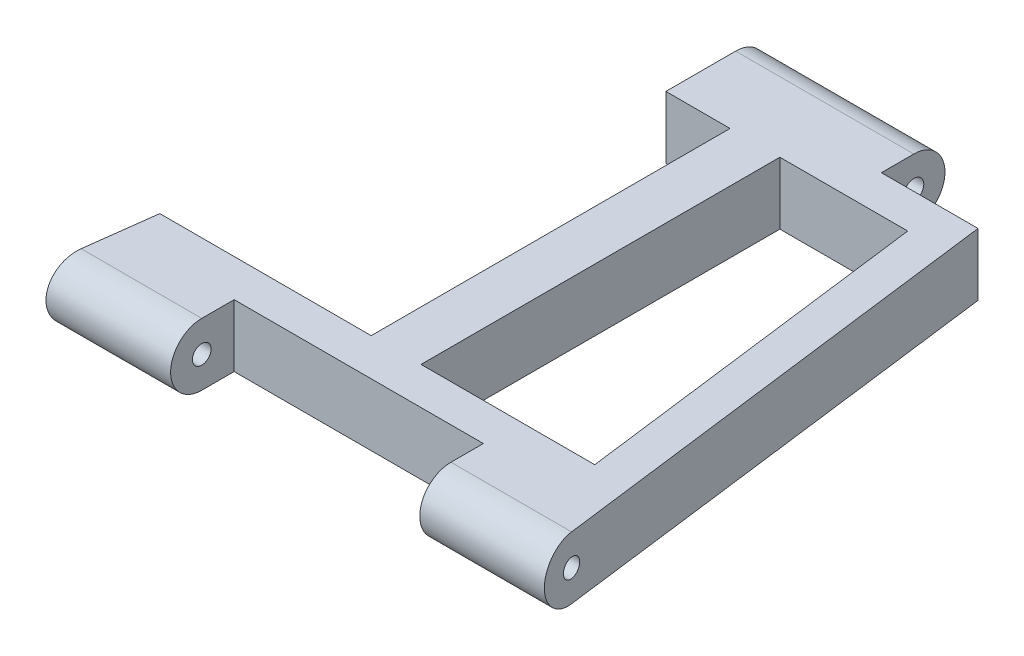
ISO-10303-21;
HEADER;
FILE_DESCRIPTION(('STEP AP214'),'2;1');
FILE_NAME('part.step','',(''),(''),'','','');
FILE_SCHEMA(('AUTOMOTIVE_DESIGN { 1 0 10303 214 1 1 1 1 }'));
ENDSEC;
DATA;
#1=APPLICATION_CONTEXT('core data for automotive mechanical design processes');
#2=APPLICATION_PROTOCOL_DEFINITION('international standard','automotive_design',2000,#1);
#3=PRODUCT_CONTEXT('',#1,'mechanical');
#4=PRODUCT('Part','Part','',(#3));
#5=PRODUCT_RELATED_PRODUCT_CATEGORY('part','',(#4));
#6=PRODUCT_DEFINITION_FORMATION('','',#4);
#7=PRODUCT_DEFINITION_CONTEXT('part definition',#1,'design');
#8=PRODUCT_DEFINITION('design','',#6,#7);
#9=PRODUCT_DEFINITION_SHAPE('','',#8);
#10=(LENGTH_UNIT() NAMED_UNIT(*) SI_UNIT(.MILLI.,.METRE.));
#11=(NAMED_UNIT(*) PLANE_ANGLE_UNIT() SI_UNIT($,.RADIAN.));
#12=(NAMED_UNIT(*) SI_UNIT($,.STERADIAN.) SOLID_ANGLE_UNIT());
#13=UNCERTAINTY_MEASURE_WITH_UNIT(LENGTH_MEASURE(1.E-05),#10,'distance_accuracy_value','');
#14=(GEOMETRIC_REPRESENTATION_CONTEXT(3) GLOBAL_UNCERTAINTY_ASSIGNED_CONTEXT((#13)) GLOBAL_UNIT_ASSIGNED_CONTEXT((#10,
#11,#12)) REPRESENTATION_CONTEXT('',''));
#15=CARTESIAN_POINT('',(0.,0.,0.));
#16=DIRECTION('',(0.,0.,1.));
#17=DIRECTION('',(1.,0.,0.));
#18=AXIS2_PLACEMENT_3D('',#15,#16,#17);
#19=CARTESIAN_POINT('',(-56.5293337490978,10.,7.22319264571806));
#20=DIRECTION('',(0.991935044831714,0.,-0.126747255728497));
#21=DIRECTION('',(-0.126747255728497,0.,-0.991935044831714));
#22=AXIS2_PLACEMENT_3D('',#19,#20,#21);
#23=PLANE('',#22);
#24=CARTESIAN_POINT('',(-60.1764107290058,5.,-21.3191489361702));
#25=DIRECTION('',(0.991935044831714,0.,-0.126747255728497));
#26=DIRECTION('',(-0.126747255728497,0.,-0.991935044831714));
#27=AXIS2_PLACEMENT_3D('',#24,#25,#26);
#28=ELLIPSE('',#27,1.5121957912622,1.5);
#29=CARTESIAN_POINT('',(-60.3680773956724,5.,-22.8191489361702));
#30=VERTEX_POINT('',#29);
#31=EDGE_CURVE('E379',#30,#30,#28,.T.);
#32=ORIENTED_EDGE('',*,*,#31,.F.);
#33=EDGE_LOOP('',(#32));
#34=FACE_BOUND('',#33,.T.);
#35=CARTESIAN_POINT('',(-60.1764107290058,5.,-21.3191489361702));
#36=DIRECTION('',(0.991935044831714,0.,-0.126747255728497));
#37=DIRECTION('',(-0.126747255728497,0.,-0.991935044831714));
#38=AXIS2_PLACEMENT_3D('',#35,#36,#37);
#39=ELLIPSE('',#38,5.04065263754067,5.);
#40=CARTESIAN_POINT('',(-60.1764107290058,10.,-21.3191489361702));
#41=VERTEX_POINT('',#40);
#42=CARTESIAN_POINT('',(-60.1764107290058,0.,-21.3191489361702));
#43=VERTEX_POINT('',#42);
#44=EDGE_CURVE('E286',#41,#43,#39,.T.);
#45=ORIENTED_EDGE('',*,*,#44,.T.);
#46=DIRECTION('',(0.126747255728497,0.,0.991935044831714));
#47=VECTOR('',#46,1.);
#48=CARTESIAN_POINT('',(-56.5293337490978,0.,7.22319264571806));
#49=LINE('',#48,#47);
#50=CARTESIAN_POINT('',(-69.7341885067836,0.,-96.1191489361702));
#51=VERTEX_POINT('',#50);
#52=EDGE_CURVE('E289',#51,#43,#49,.T.);
#53=ORIENTED_EDGE('',*,*,#52,.F.);
#54=DIRECTION('',(0.,-1.,0.));
#55=VECTOR('',#54,1.);
#56=CARTESIAN_POINT('',(-69.7341885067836,10.,-96.1191489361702));
#57=LINE('',#56,#55);
#58=CARTESIAN_POINT('',(-69.7341885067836,10.,-96.1191489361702));
#59=VERTEX_POINT('',#58);
#60=EDGE_CURVE('E170',#59,#51,#57,.T.);
#61=ORIENTED_EDGE('',*,*,#60,.F.);
#62=DIRECTION('',(0.126747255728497,0.,0.991935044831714));
#63=VECTOR('',#62,1.);
#64=CARTESIAN_POINT('',(-56.5293337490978,10.,7.22319264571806));
#65=LINE('',#64,#63);
#66=EDGE_CURVE('E292',#59,#41,#65,.T.);
#67=ORIENTED_EDGE('',*,*,#66,.T.);
#68=EDGE_LOOP('',(#45,#53,#61,#67));
#69=FACE_BOUND('',#68,.T.);
#70=ADVANCED_FACE('F162',(#34,#69),#23,.T.);
#71=CARTESIAN_POINT('',(-139.3475958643,10.,-17.805526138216));
#72=DIRECTION('',(0.991935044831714,0.,0.126747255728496));
#73=DIRECTION('',(0.126747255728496,0.,-0.991935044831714));
#74=AXIS2_PLACEMENT_3D('',#71,#72,#73);
#75=PLANE('',#74);
#76=CARTESIAN_POINT('',(-138.898632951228,5.,-21.3191489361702));
#77=DIRECTION('',(0.991935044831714,0.,0.126747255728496));
#78=DIRECTION('',(-0.126747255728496,0.,0.991935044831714));
#79=AXIS2_PLACEMENT_3D('',#76,#77,#78);
#80=ELLIPSE('',#79,1.5121957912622,1.5);
#81=CARTESIAN_POINT('',(-139.090299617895,5.,-19.8191489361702));
#82=VERTEX_POINT('',#81);
#83=EDGE_CURVE('E373',#82,#82,#80,.T.);
#84=ORIENTED_EDGE('',*,*,#83,.T.);
#85=EDGE_LOOP('',(#84));
#86=FACE_BOUND('',#85,.T.);
#87=DIRECTION('',(-0.126747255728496,0.,0.991935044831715));
#88=VECTOR('',#87,1.);
#89=CARTESIAN_POINT('',(-139.3475958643,0.,-17.805526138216));
#90=LINE('',#89,#88);
#91=CARTESIAN_POINT('',(-137.467521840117,0.,-32.5191489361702));
#92=VERTEX_POINT('',#91);
#93=CARTESIAN_POINT('',(-138.898632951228,0.,-21.3191489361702));
#94=VERTEX_POINT('',#93);
#95=EDGE_CURVE('E325',#92,#94,#90,.T.);
#96=ORIENTED_EDGE('',*,*,#95,.T.);
#97=CARTESIAN_POINT('',(-138.898632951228,5.,-21.3191489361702));
#98=DIRECTION('',(0.991935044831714,0.,0.126747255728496));
#99=DIRECTION('',(-0.126747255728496,0.,0.991935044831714));
#100=AXIS2_PLACEMENT_3D('',#97,#98,#99);
#101=ELLIPSE('',#100,5.04065263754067,5.);
#102=CARTESIAN_POINT('',(-138.898632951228,10.,-21.3191489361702));
#103=VERTEX_POINT('',#102);
#104=EDGE_CURVE('E294',#103,#94,#101,.T.);
#105=ORIENTED_EDGE('',*,*,#104,.F.);
#106=DIRECTION('',(-0.126747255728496,0.,0.991935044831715));
#107=VECTOR('',#106,1.);
#108=CARTESIAN_POINT('',(-139.3475958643,10.,-17.805526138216));
#109=LINE('',#108,#107);
#110=CARTESIAN_POINT('',(-137.467521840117,10.,-32.5191489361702));
#111=VERTEX_POINT('',#110);
#112=EDGE_CURVE('E421',#111,#103,#109,.T.);
#113=ORIENTED_EDGE('',*,*,#112,.F.);
#114=DIRECTION('',(0.,-1.,0.));
#115=VECTOR('',#114,1.);
#116=CARTESIAN_POINT('',(-137.467521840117,10.,-32.5191489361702));
#117=LINE('',#116,#115);
#118=EDGE_CURVE('E342',#111,#92,#117,.T.);
#119=ORIENTED_EDGE('',*,*,#118,.T.);
#120=EDGE_LOOP('',(#96,#105,#113,#119));
#121=FACE_BOUND('',#120,.T.);
#122=ADVANCED_FACE('F470',(#86,#121),#75,.F.);
#123=CARTESIAN_POINT('',(-119.537521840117,10.,0.));
#124=DIRECTION('',(1.,0.,0.));
#125=DIRECTION('',(0.,0.,-1.));
#126=AXIS2_PLACEMENT_3D('',#123,#124,#125);
#127=PLANE('',#126);
#128=CARTESIAN_POINT('',(-119.537521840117,5.,-21.3191489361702));
#129=DIRECTION('',(1.,0.,0.));
#130=DIRECTION('',(0.,0.,-1.));
#131=AXIS2_PLACEMENT_3D('',#128,#129,#130);
#132=CIRCLE('',#131,1.5);
#133=CARTESIAN_POINT('',(-119.537521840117,5.,-22.8191489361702));
#134=VERTEX_POINT('',#133);
#135=EDGE_CURVE('E369',#134,#134,#132,.T.);
#136=ORIENTED_EDGE('',*,*,#135,.F.);
#137=EDGE_LOOP('',(#136));
#138=FACE_BOUND('',#137,.T.);
#139=CARTESIAN_POINT('',(-119.537521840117,5.,-21.3191489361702));
#140=DIRECTION('',(1.,0.,0.));
#141=DIRECTION('',(0.,0.,-1.));
#142=AXIS2_PLACEMENT_3D('',#139,#140,#141);
#143=CIRCLE('',#142,5.);
#144=CARTESIAN_POINT('',(-119.537521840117,10.,-21.3191489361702));
#145=VERTEX_POINT('',#144);
#146=CARTESIAN_POINT('',(-119.537521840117,0.,-21.3191489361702));
#147=VERTEX_POINT('',#146);
#148=EDGE_CURVE('E382',#145,#147,#143,.T.);
#149=ORIENTED_EDGE('',*,*,#148,.T.);
#150=DIRECTION('',(0.,0.,1.));
#151=VECTOR('',#150,1.);
#152=CARTESIAN_POINT('',(-119.537521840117,0.,0.));
#153=LINE('',#152,#151);
#154=CARTESIAN_POINT('',(-119.537521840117,0.,-26.5191489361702));
#155=VERTEX_POINT('',#154);
#156=EDGE_CURVE('E328',#155,#147,#153,.T.);
#157=ORIENTED_EDGE('',*,*,#156,.F.);
#158=DIRECTION('',(0.,-1.,0.));
#159=VECTOR('',#158,1.);
#160=CARTESIAN_POINT('',(-119.537521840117,10.,-26.5191489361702));
#161=LINE('',#160,#159);
#162=CARTESIAN_POINT('',(-119.537521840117,10.,-26.5191489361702));
#163=VERTEX_POINT('',#162);
#164=EDGE_CURVE('E339',#163,#155,#161,.T.);
#165=ORIENTED_EDGE('',*,*,#164,.F.);
#166=DIRECTION('',(0.,0.,1.));
#167=VECTOR('',#166,1.);
#168=CARTESIAN_POINT('',(-119.537521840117,10.,0.));
#169=LINE('',#168,#167);
#170=EDGE_CURVE('E424',#163,#145,#169,.T.);
#171=ORIENTED_EDGE('',*,*,#170,.T.);
#172=EDGE_LOOP('',(#149,#157,#165,#171));
#173=FACE_BOUND('',#172,.T.);
#174=ADVANCED_FACE('F476',(#138,#173),#127,.T.);
#175=CARTESIAN_POINT('',(-79.5375218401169,10.,0.));
#176=DIRECTION('',(1.,0.,0.));
#177=DIRECTION('',(0.,0.,-1.));
#178=AXIS2_PLACEMENT_3D('',#175,#176,#177);
#179=PLANE('',#178);
#180=CARTESIAN_POINT('',(-79.5375218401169,5.,-21.3191489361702));
#181=DIRECTION('',(1.,0.,0.));
#182=DIRECTION('',(0.,0.,-1.));
#183=AXIS2_PLACEMENT_3D('',#180,#181,#182);
#184=CIRCLE('',#183,1.5);
#185=CARTESIAN_POINT('',(-79.5375218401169,5.,-22.8191489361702));
#186=VERTEX_POINT('',#185);
#187=EDGE_CURVE('E367',#186,#186,#184,.T.);
#188=ORIENTED_EDGE('',*,*,#187,.T.);
#189=EDGE_LOOP('',(#188));
#190=FACE_BOUND('',#189,.T.);
#191=DIRECTION('',(0.,0.,1.));
#192=VECTOR('',#191,1.);
#193=CARTESIAN_POINT('',(-79.5375218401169,0.,0.));
#194=LINE('',#193,#192);
#195=CARTESIAN_POINT('',(-79.5375218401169,0.,-26.5191489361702));
#196=VERTEX_POINT('',#195);
#197=CARTESIAN_POINT('',(-79.5375218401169,0.,-21.3191489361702));
#198=VERTEX_POINT('',#197);
#199=EDGE_CURVE('E333',#196,#198,#194,.T.);
#200=ORIENTED_EDGE('',*,*,#199,.T.);
#201=CARTESIAN_POINT('',(-79.5375218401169,5.,-21.3191489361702));
#202=DIRECTION('',(1.,0.,0.));
#203=DIRECTION('',(0.,0.,-1.));
#204=AXIS2_PLACEMENT_3D('',#201,#202,#203);
#205=CIRCLE('',#204,5.);
#206=CARTESIAN_POINT('',(-79.5375218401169,10.,-21.3191489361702));
#207=VERTEX_POINT('',#206);
#208=EDGE_CURVE('E12',#207,#198,#205,.T.);
#209=ORIENTED_EDGE('',*,*,#208,.F.);
#210=DIRECTION('',(0.,0.,1.));
#211=VECTOR('',#210,1.);
#212=CARTESIAN_POINT('',(-79.5375218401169,10.,0.));
#213=LINE('',#212,#211);
#214=CARTESIAN_POINT('',(-79.5375218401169,10.,-26.5191489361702));
#215=VERTEX_POINT('',#214);
#216=EDGE_CURVE('E362',#215,#207,#213,.T.);
#217=ORIENTED_EDGE('',*,*,#216,.F.);
#218=DIRECTION('',(0.,-1.,0.));
#219=VECTOR('',#218,1.);
#220=CARTESIAN_POINT('',(-79.5375218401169,10.,-26.5191489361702));
#221=LINE('',#220,#219);
#222=EDGE_CURVE('E336',#215,#196,#221,.T.);
#223=ORIENTED_EDGE('',*,*,#222,.T.);
#224=EDGE_LOOP('',(#200,#209,#217,#223));
#225=FACE_BOUND('',#224,.T.);
#226=ADVANCED_FACE('F505',(#190,#225),#179,.F.);
#227=CARTESIAN_POINT('',(-85.2375218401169,10.,0.));
#228=DIRECTION('',(1.,0.,0.));
#229=DIRECTION('',(0.,0.,-1.));
#230=AXIS2_PLACEMENT_3D('',#227,#228,#229);
#231=PLANE('',#230);
#232=CARTESIAN_POINT('',(-85.2375218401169,5.,-101.31914893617));
#233=DIRECTION('',(1.,0.,0.));
#234=DIRECTION('',(0.,0.,-1.));
#235=AXIS2_PLACEMENT_3D('',#232,#233,#234);
#236=CIRCLE('',#235,1.60000000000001);
#237=CARTESIAN_POINT('',(-85.2375218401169,5.,-102.91914893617));
#238=VERTEX_POINT('',#237);
#239=EDGE_CURVE('E394',#238,#238,#236,.F.);
#240=ORIENTED_EDGE('',*,*,#239,.T.);
#241=EDGE_LOOP('',(#240));
#242=FACE_BOUND('',#241,.T.);
#243=DIRECTION('',(0.,0.,1.));
#244=VECTOR('',#243,1.);
#245=CARTESIAN_POINT('',(-85.2375218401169,0.,0.));
#246=LINE('',#245,#244);
#247=CARTESIAN_POINT('',(-85.2375218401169,0.,-101.31914893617));
#248=VERTEX_POINT('',#247);
#249=CARTESIAN_POINT('',(-85.2375218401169,0.,-96.1191489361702));
#250=VERTEX_POINT('',#249);
#251=EDGE_CURVE('E310',#248,#250,#246,.T.);
#252=ORIENTED_EDGE('',*,*,#251,.F.);
#253=CARTESIAN_POINT('',(-85.2375218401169,5.,-101.31914893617));
#254=DIRECTION('',(1.,0.,0.));
#255=DIRECTION('',(0.,0.,-1.));
#256=AXIS2_PLACEMENT_3D('',#253,#254,#255);
#257=CIRCLE('',#256,5.);
#258=CARTESIAN_POINT('',(-85.2375218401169,10.,-101.31914893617));
#259=VERTEX_POINT('',#258);
#260=EDGE_CURVE('E386',#259,#248,#257,.F.);
#261=ORIENTED_EDGE('',*,*,#260,.F.);
#262=DIRECTION('',(0.,0.,1.));
#263=VECTOR('',#262,1.);
#264=CARTESIAN_POINT('',(-85.2375218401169,10.,0.));
#265=LINE('',#264,#263);
#266=CARTESIAN_POINT('',(-85.2375218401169,10.,-96.1191489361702));
#267=VERTEX_POINT('',#266);
#268=EDGE_CURVE('E411',#259,#267,#265,.T.);
#269=ORIENTED_EDGE('',*,*,#268,.T.);
#270=DIRECTION('',(0.,-1.,0.));
#271=VECTOR('',#270,1.);
#272=CARTESIAN_POINT('',(-85.2375218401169,10.,-96.1191489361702));
#273=LINE('',#272,#271);
#274=EDGE_CURVE('E354',#267,#250,#273,.T.);
#275=ORIENTED_EDGE('',*,*,#274,.T.);
#276=EDGE_LOOP('',(#252,#261,#269,#275));
#277=FACE_BOUND('',#276,.T.);
#278=ADVANCED_FACE('F516',(#242,#277),#231,.T.);
#279=CARTESIAN_POINT('',(-113.837521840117,10.,0.));
#280=DIRECTION('',(1.,0.,0.));
#281=DIRECTION('',(0.,0.,-1.));
#282=AXIS2_PLACEMENT_3D('',#279,#280,#281);
#283=PLANE('',#282);
#284=CARTESIAN_POINT('',(-113.837521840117,5.,-101.31914893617));
#285=DIRECTION('',(-1.,0.,0.));
#286=DIRECTION('',(0.,0.,1.));
#287=AXIS2_PLACEMENT_3D('',#284,#285,#286);
#288=CIRCLE('',#287,1.60000000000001);
#289=CARTESIAN_POINT('',(-113.837521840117,5.,-99.7191489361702));
#290=VERTEX_POINT('',#289);
#291=EDGE_CURVE('E388',#290,#290,#288,.T.);
#292=ORIENTED_EDGE('',*,*,#291,.F.);
#293=EDGE_LOOP('',(#292));
#294=FACE_BOUND('',#293,.T.);
#295=CARTESIAN_POINT('',(-113.837521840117,5.,-101.31914893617));
#296=DIRECTION('',(-1.,0.,0.));
#297=DIRECTION('',(0.,0.,1.));
#298=AXIS2_PLACEMENT_3D('',#295,#296,#297);
#299=CIRCLE('',#298,5.);
#300=CARTESIAN_POINT('',(-113.837521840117,10.,-101.31914893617));
#301=VERTEX_POINT('',#300);
#302=CARTESIAN_POINT('',(-113.837521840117,0.,-101.31914893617));
#303=VERTEX_POINT('',#302);
#304=EDGE_CURVE('E184',#301,#303,#299,.T.);
#305=ORIENTED_EDGE('',*,*,#304,.T.);
#306=DIRECTION('',(0.,0.,1.));
#307=VECTOR('',#306,1.);
#308=CARTESIAN_POINT('',(-113.837521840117,0.,0.));
#309=LINE('',#308,#307);
#310=CARTESIAN_POINT('',(-113.837521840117,0.,-90.1191489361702));
#311=VERTEX_POINT('',#310);
#312=EDGE_CURVE('E317',#303,#311,#309,.T.);
#313=ORIENTED_EDGE('',*,*,#312,.T.);
#314=DIRECTION('',(0.,-1.,0.));
#315=VECTOR('',#314,1.);
#316=CARTESIAN_POINT('',(-113.837521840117,10.,-90.1191489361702));
#317=LINE('',#316,#315);
#318=CARTESIAN_POINT('',(-113.837521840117,10.,-90.1191489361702));
#319=VERTEX_POINT('',#318);
#320=EDGE_CURVE('E351',#319,#311,#317,.T.);
#321=ORIENTED_EDGE('',*,*,#320,.F.);
#322=DIRECTION('',(0.,0.,1.));
#323=VECTOR('',#322,1.);
#324=CARTESIAN_POINT('',(-113.837521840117,10.,0.));
#325=LINE('',#324,#323);
#326=EDGE_CURVE('E413',#301,#319,#325,.T.);
#327=ORIENTED_EDGE('',*,*,#326,.F.);
#328=EDGE_LOOP('',(#305,#313,#321,#327));
#329=FACE_BOUND('',#328,.T.);
#330=ADVANCED_FACE('F466',(#294,#329),#283,.F.);
#331=CARTESIAN_POINT('',(0.,0.,0.));
#332=DIRECTION('',(0.,1.,0.));
#333=DIRECTION('',(0.,0.,1.));
#334=AXIS2_PLACEMENT_3D('',#331,#332,#333);
#335=PLANE('',#334);
#336=DIRECTION('',(0.126747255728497,0.,0.991935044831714));
#337=VECTOR('',#336,1.);
#338=CARTESIAN_POINT('',(-62.4809440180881,0.,7.98367618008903));
#339=LINE('',#338,#337);
#340=CARTESIAN_POINT('',(-75.0163050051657,0.,-90.1191489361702));
#341=VERTEX_POINT('',#340);
#342=CARTESIAN_POINT('',(-67.6563050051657,0.,-32.5191489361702));
#343=VERTEX_POINT('',#342);
#344=EDGE_CURVE('E397',#341,#343,#339,.T.);
#345=ORIENTED_EDGE('',*,*,#344,.F.);
#346=DIRECTION('',(1.,0.,0.));
#347=VECTOR('',#346,1.);
#348=CARTESIAN_POINT('',(0.,0.,-90.1191489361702));
#349=LINE('',#348,#347);
#350=CARTESIAN_POINT('',(-95.5375218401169,0.,-90.1191489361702));
#351=VERTEX_POINT('',#350);
#352=EDGE_CURVE('E308',#351,#341,#349,.T.);
#353=ORIENTED_EDGE('',*,*,#352,.F.);
#354=DIRECTION('',(0.,0.,1.));
#355=VECTOR('',#354,1.);
#356=CARTESIAN_POINT('',(-95.5375218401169,0.,0.));
#357=LINE('',#356,#355);
#358=CARTESIAN_POINT('',(-95.5375218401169,0.,-32.5191489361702));
#359=VERTEX_POINT('',#358);
#360=EDGE_CURVE('E312',#351,#359,#357,.T.);
#361=ORIENTED_EDGE('',*,*,#360,.T.);
#362=DIRECTION('',(-1.,0.,0.));
#363=VECTOR('',#362,1.);
#364=CARTESIAN_POINT('',(0.,0.,-32.5191489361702));
#365=LINE('',#364,#363);
#366=EDGE_CURVE('E433',#343,#359,#365,.T.);
#367=ORIENTED_EDGE('',*,*,#366,.F.);
#368=EDGE_LOOP('',(#345,#353,#361,#367));
#369=FACE_BOUND('',#368,.T.);
#370=ORIENTED_EDGE('',*,*,#52,.T.);
#371=DIRECTION('',(-1.,0.,0.));
#372=VECTOR('',#371,1.);
#373=CARTESIAN_POINT('',(-59.5375218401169,0.,-21.3191489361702));
#374=LINE('',#373,#372);
#375=EDGE_CURVE('E297',#43,#198,#374,.T.);
#376=ORIENTED_EDGE('',*,*,#375,.T.);
#377=ORIENTED_EDGE('',*,*,#199,.F.);
#378=DIRECTION('',(1.,0.,0.));
#379=VECTOR('',#378,1.);
#380=CARTESIAN_POINT('',(0.,0.,-26.5191489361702));
#381=LINE('',#380,#379);
#382=EDGE_CURVE('E331',#155,#196,#381,.T.);
#383=ORIENTED_EDGE('',*,*,#382,.F.);
#384=ORIENTED_EDGE('',*,*,#156,.T.);
#385=EDGE_CURVE('E303',#147,#94,#374,.T.);
#386=ORIENTED_EDGE('',*,*,#385,.T.);
#387=ORIENTED_EDGE('',*,*,#95,.F.);
#388=DIRECTION('',(-1.,0.,0.));
#389=VECTOR('',#388,1.);
#390=CARTESIAN_POINT('',(0.,0.,-32.5191489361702));
#391=LINE('',#390,#389);
#392=CARTESIAN_POINT('',(-103.537521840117,0.,-32.5191489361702));
#393=VERTEX_POINT('',#392);
#394=EDGE_CURVE('E323',#393,#92,#391,.T.);
#395=ORIENTED_EDGE('',*,*,#394,.F.);
#396=DIRECTION('',(0.,0.,1.));
#397=VECTOR('',#396,1.);
#398=CARTESIAN_POINT('',(-103.537521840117,0.,0.));
#399=LINE('',#398,#397);
#400=CARTESIAN_POINT('',(-103.537521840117,0.,-90.1191489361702));
#401=VERTEX_POINT('',#400);
#402=EDGE_CURVE('E321',#401,#393,#399,.T.);
#403=ORIENTED_EDGE('',*,*,#402,.F.);
#404=DIRECTION('',(1.,0.,0.));
#405=VECTOR('',#404,1.);
#406=CARTESIAN_POINT('',(0.,0.,-90.1191489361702));
#407=LINE('',#406,#405);
#408=EDGE_CURVE('E319',#311,#401,#407,.T.);
#409=ORIENTED_EDGE('',*,*,#408,.F.);
#410=ORIENTED_EDGE('',*,*,#312,.F.);
#411=DIRECTION('',(-1.,0.,0.));
#412=VECTOR('',#411,1.);
#413=CARTESIAN_POINT('',(-78.1664540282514,0.,-101.31914893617));
#414=LINE('',#413,#412);
#415=EDGE_CURVE('E293',#248,#303,#414,.T.);
#416=ORIENTED_EDGE('',*,*,#415,.F.);
#417=ORIENTED_EDGE('',*,*,#251,.T.);
#418=DIRECTION('',(1.,0.,0.));
#419=VECTOR('',#418,1.);
#420=CARTESIAN_POINT('',(0.,0.,-96.1191489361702));
#421=LINE('',#420,#419);
#422=EDGE_CURVE('E307',#250,#51,#421,.T.);
#423=ORIENTED_EDGE('',*,*,#422,.T.);
#424=EDGE_LOOP('',(#370,#376,#377,#383,#384,#386,#387,#395,#403,#409,#410,#416,#417,#423));
#425=FACE_BOUND('',#424,.T.);
#426=ADVANCED_FACE('F305',(#369,#425),#335,.F.);
#427=CARTESIAN_POINT('',(0.,10.,0.));
#428=DIRECTION('',(0.,1.,0.));
#429=DIRECTION('',(0.,0.,1.));
#430=AXIS2_PLACEMENT_3D('',#427,#428,#429);
#431=PLANE('',#430);
#432=DIRECTION('',(-1.,0.,0.));
#433=VECTOR('',#432,1.);
#434=CARTESIAN_POINT('',(-59.5375218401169,10.,-21.3191489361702));
#435=LINE('',#434,#433);
#436=EDGE_CURVE('E176',#41,#207,#435,.T.);
#437=ORIENTED_EDGE('',*,*,#436,.F.);
#438=ORIENTED_EDGE('',*,*,#66,.F.);
#439=DIRECTION('',(1.,0.,0.));
#440=VECTOR('',#439,1.);
#441=CARTESIAN_POINT('',(0.,10.,-96.1191489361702));
#442=LINE('',#441,#440);
#443=EDGE_CURVE('E408',#267,#59,#442,.T.);
#444=ORIENTED_EDGE('',*,*,#443,.F.);
#445=ORIENTED_EDGE('',*,*,#268,.F.);
#446=DIRECTION('',(-1.,0.,0.));
#447=VECTOR('',#446,1.);
#448=CARTESIAN_POINT('',(-78.1664540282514,10.,-101.31914893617));
#449=LINE('',#448,#447);
#450=EDGE_CURVE('E389',#259,#301,#449,.T.);
#451=ORIENTED_EDGE('',*,*,#450,.T.);
#452=ORIENTED_EDGE('',*,*,#326,.T.);
#453=DIRECTION('',(1.,0.,0.));
#454=VECTOR('',#453,1.);
#455=CARTESIAN_POINT('',(0.,10.,-90.1191489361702));
#456=LINE('',#455,#454);
#457=CARTESIAN_POINT('',(-103.537521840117,10.,-90.1191489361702));
#458=VERTEX_POINT('',#457);
#459=EDGE_CURVE('E415',#319,#458,#456,.T.);
#460=ORIENTED_EDGE('',*,*,#459,.T.);
#461=DIRECTION('',(0.,0.,1.));
#462=VECTOR('',#461,1.);
#463=CARTESIAN_POINT('',(-103.537521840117,10.,0.));
#464=LINE('',#463,#462);
#465=CARTESIAN_POINT('',(-103.537521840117,10.,-32.5191489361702));
#466=VERTEX_POINT('',#465);
#467=EDGE_CURVE('E417',#458,#466,#464,.T.);
#468=ORIENTED_EDGE('',*,*,#467,.T.);
#469=DIRECTION('',(-1.,0.,0.));
#470=VECTOR('',#469,1.);
#471=CARTESIAN_POINT('',(0.,10.,-32.5191489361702));
#472=LINE('',#471,#470);
#473=EDGE_CURVE('E419',#466,#111,#472,.T.);
#474=ORIENTED_EDGE('',*,*,#473,.T.);
#475=ORIENTED_EDGE('',*,*,#112,.T.);
#476=EDGE_CURVE('E302',#145,#103,#435,.T.);
#477=ORIENTED_EDGE('',*,*,#476,.F.);
#478=ORIENTED_EDGE('',*,*,#170,.F.);
#479=DIRECTION('',(1.,0.,0.));
#480=VECTOR('',#479,1.);
#481=CARTESIAN_POINT('',(0.,10.,-26.5191489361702));
#482=LINE('',#481,#480);
#483=EDGE_CURVE('E427',#163,#215,#482,.T.);
#484=ORIENTED_EDGE('',*,*,#483,.T.);
#485=ORIENTED_EDGE('',*,*,#216,.T.);
#486=EDGE_LOOP('',(#437,#438,#444,#445,#451,#452,#460,#468,#474,#475,#477,#478,#484,#485));
#487=FACE_BOUND('',#486,.T.);
#488=DIRECTION('',(0.126747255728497,0.,0.991935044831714));
#489=VECTOR('',#488,1.);
#490=CARTESIAN_POINT('',(-62.4809440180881,10.,7.98367618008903));
#491=LINE('',#490,#489);
#492=CARTESIAN_POINT('',(-75.0163050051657,10.,-90.1191489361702));
#493=VERTEX_POINT('',#492);
#494=CARTESIAN_POINT('',(-67.6563050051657,10.,-32.5191489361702));
#495=VERTEX_POINT('',#494);
#496=EDGE_CURVE('E335',#493,#495,#491,.T.);
#497=ORIENTED_EDGE('',*,*,#496,.T.);
#498=DIRECTION('',(-1.,0.,0.));
#499=VECTOR('',#498,1.);
#500=CARTESIAN_POINT('',(0.,10.,-32.5191489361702));
#501=LINE('',#500,#499);
#502=CARTESIAN_POINT('',(-95.5375218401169,10.,-32.5191489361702));
#503=VERTEX_POINT('',#502);
#504=EDGE_CURVE('E400',#495,#503,#501,.T.);
#505=ORIENTED_EDGE('',*,*,#504,.T.);
#506=DIRECTION('',(0.,0.,1.));
#507=VECTOR('',#506,1.);
#508=CARTESIAN_POINT('',(-95.5375218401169,10.,0.));
#509=LINE('',#508,#507);
#510=CARTESIAN_POINT('',(-95.5375218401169,10.,-90.1191489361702));
#511=VERTEX_POINT('',#510);
#512=EDGE_CURVE('E402',#511,#503,#509,.T.);
#513=ORIENTED_EDGE('',*,*,#512,.F.);
#514=DIRECTION('',(1.,0.,0.));
#515=VECTOR('',#514,1.);
#516=CARTESIAN_POINT('',(0.,10.,-90.1191489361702));
#517=LINE('',#516,#515);
#518=EDGE_CURVE('E405',#511,#493,#517,.T.);
#519=ORIENTED_EDGE('',*,*,#518,.T.);
#520=EDGE_LOOP('',(#497,#505,#513,#519));
#521=FACE_BOUND('',#520,.T.);
#522=ADVANCED_FACE('F454',(#487,#521),#431,.T.);
#523=CARTESIAN_POINT('',(0.,10.,-96.1191489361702));
#524=DIRECTION('',(0.,0.,-1.));
#525=DIRECTION('',(-1.,0.,0.));
#526=AXIS2_PLACEMENT_3D('',#523,#524,#525);
#527=PLANE('',#526);
#528=ORIENTED_EDGE('',*,*,#422,.F.);
#529=ORIENTED_EDGE('',*,*,#274,.F.);
#530=ORIENTED_EDGE('',*,*,#443,.T.);
#531=ORIENTED_EDGE('',*,*,#60,.T.);
#532=EDGE_LOOP('',(#528,#529,#530,#531));
#533=FACE_BOUND('',#532,.T.);
#534=ADVANCED_FACE('F456',(#533),#527,.T.);
#535=CARTESIAN_POINT('',(0.,10.,-90.1191489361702));
#536=DIRECTION('',(0.,0.,-1.));
#537=DIRECTION('',(-1.,0.,0.));
#538=AXIS2_PLACEMENT_3D('',#535,#536,#537);
#539=PLANE('',#538);
#540=ORIENTED_EDGE('',*,*,#408,.T.);
#541=DIRECTION('',(0.,-1.,0.));
#542=VECTOR('',#541,1.);
#543=CARTESIAN_POINT('',(-103.537521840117,10.,-90.1191489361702));
#544=LINE('',#543,#542);
#545=EDGE_CURVE('E348',#458,#401,#544,.T.);
#546=ORIENTED_EDGE('',*,*,#545,.F.);
#547=ORIENTED_EDGE('',*,*,#459,.F.);
#548=ORIENTED_EDGE('',*,*,#320,.T.);
#549=EDGE_LOOP('',(#540,#546,#547,#548));
#550=FACE_BOUND('',#549,.T.);
#551=ADVANCED_FACE('F463',(#550),#539,.F.);
#552=CARTESIAN_POINT('',(-103.537521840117,10.,0.));
#553=DIRECTION('',(1.,0.,0.));
#554=DIRECTION('',(0.,0.,-1.));
#555=AXIS2_PLACEMENT_3D('',#552,#553,#554);
#556=PLANE('',#555);
#557=ORIENTED_EDGE('',*,*,#402,.T.);
#558=DIRECTION('',(0.,-1.,0.));
#559=VECTOR('',#558,1.);
#560=CARTESIAN_POINT('',(-103.537521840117,10.,-32.5191489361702));
#561=LINE('',#560,#559);
#562=EDGE_CURVE('E345',#466,#393,#561,.T.);
#563=ORIENTED_EDGE('',*,*,#562,.F.);
#564=ORIENTED_EDGE('',*,*,#467,.F.);
#565=ORIENTED_EDGE('',*,*,#545,.T.);
#566=EDGE_LOOP('',(#557,#563,#564,#565));
#567=FACE_BOUND('',#566,.T.);
#568=ADVANCED_FACE('F500',(#567),#556,.F.);
#569=CARTESIAN_POINT('',(0.,10.,-32.5191489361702));
#570=DIRECTION('',(0.,0.,1.));
#571=DIRECTION('',(1.,0.,0.));
#572=AXIS2_PLACEMENT_3D('',#569,#570,#571);
#573=PLANE('',#572);
#574=ORIENTED_EDGE('',*,*,#394,.T.);
#575=ORIENTED_EDGE('',*,*,#118,.F.);
#576=ORIENTED_EDGE('',*,*,#473,.F.);
#577=ORIENTED_EDGE('',*,*,#562,.T.);
#578=EDGE_LOOP('',(#574,#575,#576,#577));
#579=FACE_BOUND('',#578,.T.);
#580=ADVANCED_FACE('F494',(#579),#573,.F.);
#581=CARTESIAN_POINT('',(0.,10.,-26.5191489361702));
#582=DIRECTION('',(0.,0.,-1.));
#583=DIRECTION('',(-1.,0.,0.));
#584=AXIS2_PLACEMENT_3D('',#581,#582,#583);
#585=PLANE('',#584);
#586=ORIENTED_EDGE('',*,*,#382,.T.);
#587=ORIENTED_EDGE('',*,*,#222,.F.);
#588=ORIENTED_EDGE('',*,*,#483,.F.);
#589=ORIENTED_EDGE('',*,*,#164,.T.);
#590=EDGE_LOOP('',(#586,#587,#588,#589));
#591=FACE_BOUND('',#590,.T.);
#592=ADVANCED_FACE('F490',(#591),#585,.F.);
#593=CARTESIAN_POINT('',(-62.4809440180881,10.,7.98367618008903));
#594=DIRECTION('',(0.991935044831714,0.,-0.126747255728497));
#595=DIRECTION('',(-0.126747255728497,0.,-0.991935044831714));
#596=AXIS2_PLACEMENT_3D('',#593,#594,#595);
#597=PLANE('',#596);
#598=ORIENTED_EDGE('',*,*,#344,.T.);
#599=DIRECTION('',(0.,-1.,0.));
#600=VECTOR('',#599,1.);
#601=CARTESIAN_POINT('',(-67.6563050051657,10.,-32.5191489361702));
#602=LINE('',#601,#600);
#603=EDGE_CURVE('E340',#495,#343,#602,.T.);
#604=ORIENTED_EDGE('',*,*,#603,.F.);
#605=ORIENTED_EDGE('',*,*,#496,.F.);
#606=DIRECTION('',(0.,-1.,0.));
#607=VECTOR('',#606,1.);
#608=CARTESIAN_POINT('',(-75.0163050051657,10.,-90.1191489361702));
#609=LINE('',#608,#607);
#610=EDGE_CURVE('E358',#493,#341,#609,.T.);
#611=ORIENTED_EDGE('',*,*,#610,.T.);
#612=EDGE_LOOP('',(#598,#604,#605,#611));
#613=FACE_BOUND('',#612,.T.);
#614=ADVANCED_FACE('F164',(#613),#597,.F.);
#615=CARTESIAN_POINT('',(0.,10.,-32.5191489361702));
#616=DIRECTION('',(0.,0.,1.));
#617=DIRECTION('',(1.,0.,0.));
#618=AXIS2_PLACEMENT_3D('',#615,#616,#617);
#619=PLANE('',#618);
#620=ORIENTED_EDGE('',*,*,#366,.T.);
#621=DIRECTION('',(0.,-1.,0.));
#622=VECTOR('',#621,1.);
#623=CARTESIAN_POINT('',(-95.5375218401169,10.,-32.5191489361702));
#624=LINE('',#623,#622);
#625=EDGE_CURVE('E364',#503,#359,#624,.T.);
#626=ORIENTED_EDGE('',*,*,#625,.F.);
#627=ORIENTED_EDGE('',*,*,#504,.F.);
#628=ORIENTED_EDGE('',*,*,#603,.T.);
#629=EDGE_LOOP('',(#620,#626,#627,#628));
#630=FACE_BOUND('',#629,.T.);
#631=ADVANCED_FACE('F446',(#630),#619,.F.);
#632=CARTESIAN_POINT('',(-95.5375218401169,10.,0.));
#633=DIRECTION('',(1.,0.,0.));
#634=DIRECTION('',(0.,0.,-1.));
#635=AXIS2_PLACEMENT_3D('',#632,#633,#634);
#636=PLANE('',#635);
#637=ORIENTED_EDGE('',*,*,#360,.F.);
#638=DIRECTION('',(0.,-1.,0.));
#639=VECTOR('',#638,1.);
#640=CARTESIAN_POINT('',(-95.5375218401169,10.,-90.1191489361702));
#641=LINE('',#640,#639);
#642=EDGE_CURVE('E361',#511,#351,#641,.T.);
#643=ORIENTED_EDGE('',*,*,#642,.F.);
#644=ORIENTED_EDGE('',*,*,#512,.T.);
#645=ORIENTED_EDGE('',*,*,#625,.T.);
#646=EDGE_LOOP('',(#637,#643,#644,#645));
#647=FACE_BOUND('',#646,.T.);
#648=ADVANCED_FACE('F441',(#647),#636,.T.);
#649=CARTESIAN_POINT('',(0.,10.,-90.1191489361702));
#650=DIRECTION('',(0.,0.,-1.));
#651=DIRECTION('',(-1.,0.,0.));
#652=AXIS2_PLACEMENT_3D('',#649,#650,#651);
#653=PLANE('',#652);
#654=ORIENTED_EDGE('',*,*,#352,.T.);
#655=ORIENTED_EDGE('',*,*,#610,.F.);
#656=ORIENTED_EDGE('',*,*,#518,.F.);
#657=ORIENTED_EDGE('',*,*,#642,.T.);
#658=EDGE_LOOP('',(#654,#655,#656,#657));
#659=FACE_BOUND('',#658,.T.);
#660=ADVANCED_FACE('F452',(#659),#653,.F.);
#661=CARTESIAN_POINT('',(-78.1664540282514,5.,-101.31914893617));
#662=DIRECTION('',(-1.,0.,0.));
#663=DIRECTION('',(0.,0.,1.));
#664=AXIS2_PLACEMENT_3D('',#661,#662,#663);
#665=CYLINDRICAL_SURFACE('',#664,5.);
#666=ORIENTED_EDGE('',*,*,#260,.T.);
#667=ORIENTED_EDGE('',*,*,#415,.T.);
#668=ORIENTED_EDGE('',*,*,#304,.F.);
#669=ORIENTED_EDGE('',*,*,#450,.F.);
#670=EDGE_LOOP('',(#666,#667,#668,#669));
#671=FACE_BOUND('',#670,.T.);
#672=ADVANCED_FACE('F484',(#671),#665,.T.);
#673=CARTESIAN_POINT('',(-78.1664540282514,5.,-101.31914893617));
#674=DIRECTION('',(-1.,0.,0.));
#675=DIRECTION('',(0.,0.,1.));
#676=AXIS2_PLACEMENT_3D('',#673,#674,#675);
#677=CYLINDRICAL_SURFACE('',#676,1.60000000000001);
#678=ORIENTED_EDGE('',*,*,#291,.T.);
#679=EDGE_LOOP('',(#678));
#680=FACE_BOUND('',#679,.T.);
#681=ORIENTED_EDGE('',*,*,#239,.F.);
#682=EDGE_LOOP('',(#681));
#683=FACE_BOUND('',#682,.T.);
#684=ADVANCED_FACE('F574',(#680,#683),#677,.F.);
#685=CARTESIAN_POINT('',(-59.5375218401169,5.,-21.3191489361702));
#686=DIRECTION('',(-1.,0.,0.));
#687=DIRECTION('',(0.,0.,1.));
#688=AXIS2_PLACEMENT_3D('',#685,#686,#687);
#689=CYLINDRICAL_SURFACE('',#688,1.5);
#690=ORIENTED_EDGE('',*,*,#31,.T.);
#691=EDGE_LOOP('',(#690));
#692=FACE_BOUND('',#691,.T.);
#693=ORIENTED_EDGE('',*,*,#187,.F.);
#694=EDGE_LOOP('',(#693));
#695=FACE_BOUND('',#694,.T.);
#696=ADVANCED_FACE('F569',(#692,#695),#689,.F.);
#697=CARTESIAN_POINT('',(-59.5375218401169,5.,-21.3191489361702));
#698=DIRECTION('',(-1.,0.,0.));
#699=DIRECTION('',(0.,0.,1.));
#700=AXIS2_PLACEMENT_3D('',#697,#698,#699);
#701=CYLINDRICAL_SURFACE('',#700,5.);
#702=ORIENTED_EDGE('',*,*,#436,.T.);
#703=ORIENTED_EDGE('',*,*,#208,.T.);
#704=ORIENTED_EDGE('',*,*,#375,.F.);
#705=ORIENTED_EDGE('',*,*,#44,.F.);
#706=EDGE_LOOP('',(#702,#703,#704,#705));
#707=FACE_BOUND('',#706,.T.);
#708=ADVANCED_FACE('F298',(#707),#701,.T.);
#709=ORIENTED_EDGE('',*,*,#135,.T.);
#710=EDGE_LOOP('',(#709));
#711=FACE_BOUND('',#710,.T.);
#712=ORIENTED_EDGE('',*,*,#83,.F.);
#713=EDGE_LOOP('',(#712));
#714=FACE_BOUND('',#713,.T.);
#715=ADVANCED_FACE('F562',(#711,#714),#689,.F.);
#716=ORIENTED_EDGE('',*,*,#104,.T.);
#717=ORIENTED_EDGE('',*,*,#385,.F.);
#718=ORIENTED_EDGE('',*,*,#148,.F.);
#719=ORIENTED_EDGE('',*,*,#476,.T.);
#720=EDGE_LOOP('',(#716,#717,#718,#719));
#721=FACE_BOUND('',#720,.T.);
#722=ADVANCED_FACE('F560',(#721),#701,.T.);
#723=CLOSED_SHELL('',(#70,#122,#174,#226,#278,#330,#426,#522,#534,#551,#568,#580,#592,#614,#631,
#648,#660,#672,#684,#696,#708,#715,#722));
#724=MANIFOLD_SOLID_BREP('B2',#723);
#725=ADVANCED_BREP_SHAPE_REPRESENTATION('',(#18,#724),#14);
#726=SHAPE_DEFINITION_REPRESENTATION(#9,#725);
ENDSEC;
END-ISO-10303-21;
